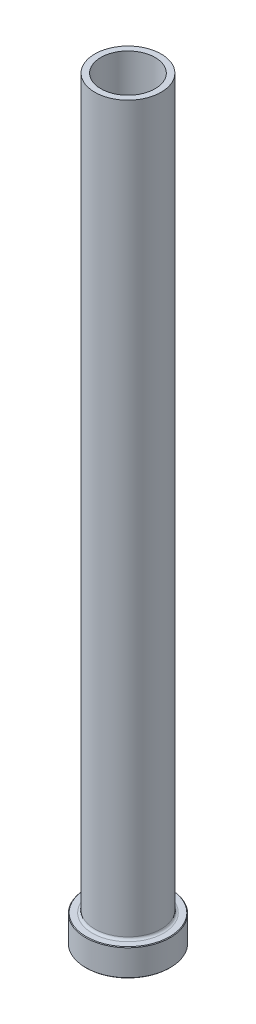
from build123d import *

# Parameters (mm, degrees)
FILLET1_R     = 0.8
CHAMFER1_SIZE = 0.2
CHAMFER3_SIZE = 0.5


with BuildPart() as part:
    # Sketch1 → Revolve1 (revolve)
    with BuildSketch(Plane.XY, mode=Mode.PRIVATE) as revolve1_sk:
        Polygon((-9, 250), (-11, 250), (-11, 9), (-14, 9), (-14, 0), (-9.25, 0), (-9.25, 183), (-9, 195), align=None)
    revolve(revolve1_sk.sketch.rotate(Axis((0, 92.187680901, 0), (0, -1, 0)), 270), axis=Axis((0, 92.187680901, 0), (0, -1, 0)))

    # Fillet1
    fillet1_edges = [part.edges().sort_by_distance(p)[0] for p in [
        (0, 9, -11),
    ]]
    fillet(fillet1_edges, radius=FILLET1_R)

    # Chamfer1
    chamfer1_edges = [part.edges().sort_by_distance(p)[0] for p in [
        (0, 0, -14),
        (0, 9, -14),
    ]]
    chamfer(chamfer1_edges, length=CHAMFER1_SIZE)

    # Chamfer3
    chamfer3_edges = [part.edges().sort_by_distance(p)[0] for p in [
        (0, 0, -9.25),
    ]]
    chamfer(chamfer3_edges, length=CHAMFER3_SIZE)


solid = part.part
